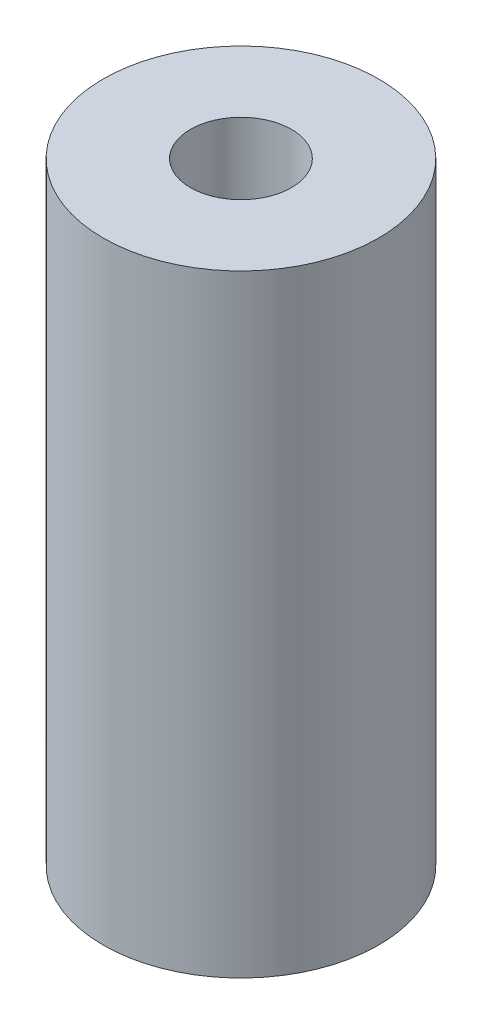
from build123d import *

# Parameters (mm, degrees)
SKETCH1_R           = 9
SKETCH1_R_2         = 3.3
BOSS_EXTRUDE1_DEPTH = 40


with BuildPart() as part:
    # Sketch1 → Boss-Extrude1 (new body)
    with BuildSketch(Plane(origin=(0, 0, 0), x_dir=(1, 0, 0), z_dir=(0, 1, 0))):
        with Locations(Location((0, 0, 0), (0, 0, 270))):
            Circle(SKETCH1_R)
        with Locations(Location((0, 0, 0), (0, 0, 270))):
            Circle(SKETCH1_R_2, mode=Mode.SUBTRACT)
    extrude(amount=BOSS_EXTRUDE1_DEPTH)


solid = part.part
